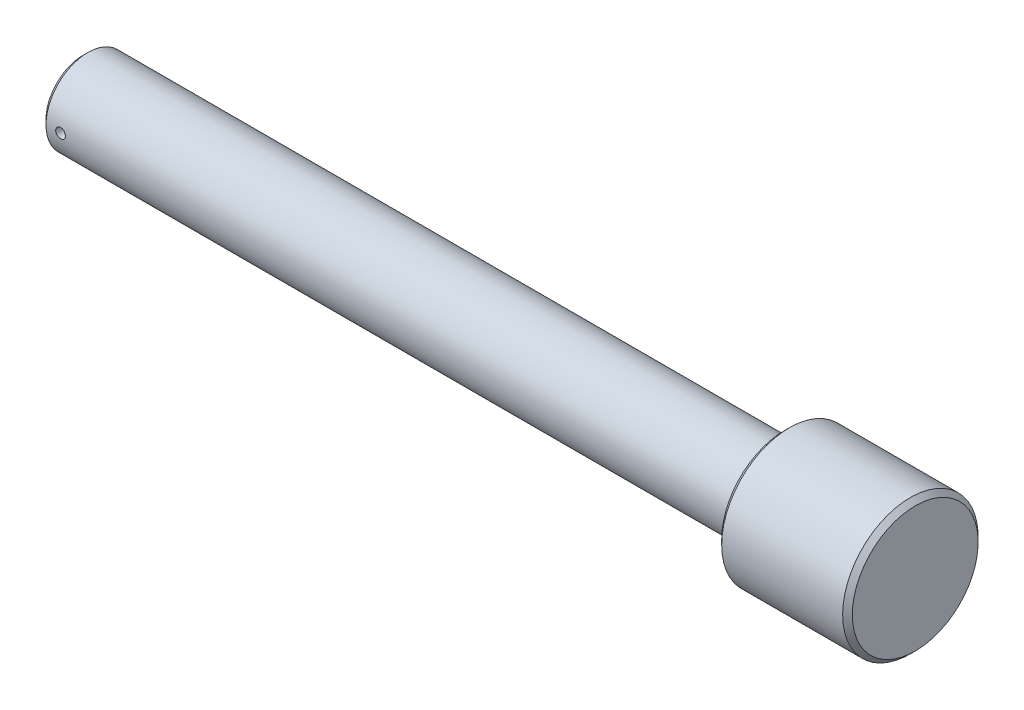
ISO-10303-21;
HEADER;
FILE_DESCRIPTION(('STEP AP214'),'2;1');
FILE_NAME('part.step','',(''),(''),'','','');
FILE_SCHEMA(('AUTOMOTIVE_DESIGN { 1 0 10303 214 1 1 1 1 }'));
ENDSEC;
DATA;
#1=APPLICATION_CONTEXT('core data for automotive mechanical design processes');
#2=APPLICATION_PROTOCOL_DEFINITION('international standard','automotive_design',2000,#1);
#3=PRODUCT_CONTEXT('',#1,'mechanical');
#4=PRODUCT('Part','Part','',(#3));
#5=PRODUCT_RELATED_PRODUCT_CATEGORY('part','',(#4));
#6=PRODUCT_DEFINITION_FORMATION('','',#4);
#7=PRODUCT_DEFINITION_CONTEXT('part definition',#1,'design');
#8=PRODUCT_DEFINITION('design','',#6,#7);
#9=PRODUCT_DEFINITION_SHAPE('','',#8);
#10=(LENGTH_UNIT() NAMED_UNIT(*) SI_UNIT(.MILLI.,.METRE.));
#11=(NAMED_UNIT(*) PLANE_ANGLE_UNIT() SI_UNIT($,.RADIAN.));
#12=(NAMED_UNIT(*) SI_UNIT($,.STERADIAN.) SOLID_ANGLE_UNIT());
#13=UNCERTAINTY_MEASURE_WITH_UNIT(LENGTH_MEASURE(1.E-05),#10,'distance_accuracy_value','');
#14=(GEOMETRIC_REPRESENTATION_CONTEXT(3) GLOBAL_UNCERTAINTY_ASSIGNED_CONTEXT((#13)) GLOBAL_UNIT_ASSIGNED_CONTEXT((#10,
#11,#12)) REPRESENTATION_CONTEXT('',''));
#15=CARTESIAN_POINT('',(0.,0.,0.));
#16=DIRECTION('',(0.,0.,1.));
#17=DIRECTION('',(1.,0.,0.));
#18=AXIS2_PLACEMENT_3D('',#15,#16,#17);
#19=CARTESIAN_POINT('',(0.,0.,0.));
#20=DIRECTION('',(1.,0.,0.));
#21=DIRECTION('',(0.,0.,-1.));
#22=AXIS2_PLACEMENT_3D('',#19,#20,#21);
#23=PLANE('',#22);
#24=CARTESIAN_POINT('',(0.,0.,0.));
#25=DIRECTION('',(-1.,0.,0.));
#26=DIRECTION('',(0.,0.,1.));
#27=AXIS2_PLACEMENT_3D('',#24,#25,#26);
#28=CIRCLE('',#27,7.65);
#29=CARTESIAN_POINT('',(0.,0.,7.65));
#30=VERTEX_POINT('',#29);
#31=EDGE_CURVE('E10',#30,#30,#28,.T.);
#32=ORIENTED_EDGE('',*,*,#31,.T.);
#33=EDGE_LOOP('',(#32));
#34=FACE_BOUND('',#33,.T.);
#35=ADVANCED_FACE('F33',(#34),#23,.F.);
#36=CARTESIAN_POINT('',(1.,0.,0.));
#37=DIRECTION('',(1.,0.,0.));
#38=DIRECTION('',(0.,0.,-1.));
#39=AXIS2_PLACEMENT_3D('',#36,#37,#38);
#40=CONICAL_SURFACE('',#39,8.65,0.785398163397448);
#41=ORIENTED_EDGE('',*,*,#31,.F.);
#42=EDGE_LOOP('',(#41));
#43=FACE_BOUND('',#42,.T.);
#44=CARTESIAN_POINT('',(1.,0.,0.));
#45=DIRECTION('',(-1.,0.,0.));
#46=DIRECTION('',(0.,0.,1.));
#47=AXIS2_PLACEMENT_3D('',#44,#45,#46);
#48=CIRCLE('',#47,8.65);
#49=CARTESIAN_POINT('',(1.,0.,8.65));
#50=VERTEX_POINT('',#49);
#51=EDGE_CURVE('E44',#50,#50,#48,.T.);
#52=ORIENTED_EDGE('',*,*,#51,.T.);
#53=EDGE_LOOP('',(#52));
#54=FACE_BOUND('',#53,.T.);
#55=ADVANCED_FACE('F86',(#43,#54),#40,.T.);
#56=CARTESIAN_POINT('',(0.,0.,0.));
#57=DIRECTION('',(-1.,0.,0.));
#58=DIRECTION('',(0.,0.,1.));
#59=AXIS2_PLACEMENT_3D('',#56,#57,#58);
#60=CYLINDRICAL_SURFACE('',#59,8.65);
#61=CARTESIAN_POINT('',(5.,0.,8.65));
#62=CARTESIAN_POINT('',(4.99999760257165,-0.0559701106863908,8.64999926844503));
#63=CARTESIAN_POINT('',(4.99528518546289,-0.111976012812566,8.64945101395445));
#64=CARTESIAN_POINT('',(4.97655951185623,-0.222431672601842,8.64731664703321));
#65=CARTESIAN_POINT('',(4.96253632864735,-0.276879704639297,8.64572942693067));
#66=CARTESIAN_POINT('',(4.92560581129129,-0.382604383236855,8.64169608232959));
#67=CARTESIAN_POINT('',(4.90270421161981,-0.433883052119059,8.63925051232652));
#68=CARTESIAN_POINT('',(4.84867895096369,-0.531858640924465,8.6337730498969));
#69=CARTESIAN_POINT('',(4.81755679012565,-0.578556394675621,8.63074126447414));
#70=CARTESIAN_POINT('',(4.74781587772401,-0.666276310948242,8.62441424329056));
#71=CARTESIAN_POINT('',(4.70916599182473,-0.707273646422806,8.6211179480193));
#72=CARTESIAN_POINT('',(4.62553347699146,-0.782215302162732,8.61464204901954));
#73=CARTESIAN_POINT('',(4.58055053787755,-0.816159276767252,8.61146245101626));
#74=CARTESIAN_POINT('',(4.4853696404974,-0.876121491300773,8.60556940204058));
#75=CARTESIAN_POINT('',(4.43515712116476,-0.902116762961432,8.60285731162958));
#76=CARTESIAN_POINT('',(4.33104285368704,-0.945296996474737,8.59822005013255));
#77=CARTESIAN_POINT('',(4.27714122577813,-0.962482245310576,8.59629485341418));
#78=CARTESIAN_POINT('',(4.16743494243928,-0.987479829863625,8.59345930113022));
#79=CARTESIAN_POINT('',(4.11163989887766,-0.995333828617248,8.59254443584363));
#80=CARTESIAN_POINT('',(3.99951670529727,-1.00157483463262,8.59181926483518));
#81=CARTESIAN_POINT('',(3.94318857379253,-0.999962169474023,8.59200892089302));
#82=CARTESIAN_POINT('',(3.83188723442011,-0.987349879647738,8.59346723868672));
#83=CARTESIAN_POINT('',(3.77690876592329,-0.97639598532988,8.59473064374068));
#84=CARTESIAN_POINT('',(3.66957571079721,-0.945483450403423,8.5981859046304));
#85=CARTESIAN_POINT('',(3.61722117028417,-0.925524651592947,8.60037777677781));
#86=CARTESIAN_POINT('',(3.51647909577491,-0.877119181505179,8.60544900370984));
#87=CARTESIAN_POINT('',(3.46810127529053,-0.84865247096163,8.60832997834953));
#88=CARTESIAN_POINT('',(3.37679228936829,-0.784053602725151,8.61445350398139));
#89=CARTESIAN_POINT('',(3.33386133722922,-0.747921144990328,8.61769606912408));
#90=CARTESIAN_POINT('',(3.25439918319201,-0.668762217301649,8.62420081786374));
#91=CARTESIAN_POINT('',(3.21790726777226,-0.625696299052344,8.62746300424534));
#92=CARTESIAN_POINT('',(3.15266439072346,-0.534029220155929,8.63362145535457));
#93=CARTESIAN_POINT('',(3.12391344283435,-0.485428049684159,8.6365177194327));
#94=CARTESIAN_POINT('',(3.07496925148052,-0.384041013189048,8.64161943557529));
#95=CARTESIAN_POINT('',(3.05477828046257,-0.331254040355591,8.64382470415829));
#96=CARTESIAN_POINT('',(3.0235574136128,-0.223007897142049,8.64729422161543));
#97=CARTESIAN_POINT('',(3.0125271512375,-0.16754883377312,8.64855850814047));
#98=CARTESIAN_POINT('',(2.99999129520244,-0.0558726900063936,8.64999874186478));
#99=CARTESIAN_POINT('',(2.99843154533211,0.000338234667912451,8.65018087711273));
#100=CARTESIAN_POINT('',(3.00473834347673,0.112220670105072,8.64945294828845));
#101=CARTESIAN_POINT('',(3.01260472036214,0.167892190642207,8.64854290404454));
#102=CARTESIAN_POINT('',(3.03749550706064,0.276957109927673,8.64573676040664));
#103=CARTESIAN_POINT('',(3.05449428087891,0.330356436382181,8.6438434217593));
#104=CARTESIAN_POINT('',(3.09714079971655,0.433546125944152,8.6392828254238));
#105=CARTESIAN_POINT('',(3.12278879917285,0.483336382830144,8.63661554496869));
#106=CARTESIAN_POINT('',(3.18213805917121,0.578137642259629,8.63078938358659));
#107=CARTESIAN_POINT('',(3.2158745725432,0.623126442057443,8.62762837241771));
#108=CARTESIAN_POINT('',(3.29039306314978,0.706822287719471,8.62117553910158));
#109=CARTESIAN_POINT('',(3.33117527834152,0.745529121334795,8.61788371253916));
#110=CARTESIAN_POINT('',(3.41886518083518,0.815752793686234,8.61152135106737));
#111=CARTESIAN_POINT('',(3.46580159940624,0.847233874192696,8.60845196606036));
#112=CARTESIAN_POINT('',(3.56432722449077,0.901865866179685,8.60290039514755));
#113=CARTESIAN_POINT('',(3.61591634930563,0.925016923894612,8.60041819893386));
#114=CARTESIAN_POINT('',(3.72216467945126,0.962273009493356,8.59632965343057));
#115=CARTESIAN_POINT('',(3.77681657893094,0.976398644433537,8.59472131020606));
#116=CARTESIAN_POINT('',(3.88773626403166,0.995269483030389,8.59255668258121));
#117=CARTESIAN_POINT('',(3.94400398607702,1.00001505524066,8.59200035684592));
#118=CARTESIAN_POINT('',(4.05620249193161,0.999984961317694,8.59200383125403));
#119=CARTESIAN_POINT('',(4.11213329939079,0.995265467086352,8.59255704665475));
#120=CARTESIAN_POINT('',(4.22240136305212,0.976557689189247,8.59470316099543));
#121=CARTESIAN_POINT('',(4.27673861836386,0.962569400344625,8.5962960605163));
#122=CARTESIAN_POINT('',(4.38227250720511,0.92573786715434,8.60034011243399));
#123=CARTESIAN_POINT('',(4.43346994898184,0.902896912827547,8.60279104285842));
#124=CARTESIAN_POINT('',(4.53131403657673,0.849014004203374,8.60827540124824));
#125=CARTESIAN_POINT('',(4.57796065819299,0.817972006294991,8.6113088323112));
#126=CARTESIAN_POINT('',(4.66566652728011,0.748358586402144,8.6176379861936));
#127=CARTESIAN_POINT('',(4.70669242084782,0.709745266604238,8.62093510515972));
#128=CARTESIAN_POINT('',(4.78170484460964,0.626171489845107,8.62740760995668));
#129=CARTESIAN_POINT('',(4.8156897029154,0.581209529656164,8.63058296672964));
#130=CARTESIAN_POINT('',(4.87574774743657,0.486048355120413,8.63646543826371));
#131=CARTESIAN_POINT('',(4.90179465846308,0.435832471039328,8.63917098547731));
#132=CARTESIAN_POINT('',(4.94505013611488,0.331737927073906,8.64379275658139));
#133=CARTESIAN_POINT('',(4.96226845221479,0.277863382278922,8.64570985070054));
#134=CARTESIAN_POINT('',(4.98318702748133,0.186416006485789,8.64806867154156));
#135=CARTESIAN_POINT('',(4.98948301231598,0.149423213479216,8.64878945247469));
#136=CARTESIAN_POINT('',(4.99789028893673,0.0749589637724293,8.6497553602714));
#137=CARTESIAN_POINT('',(5.0000016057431,0.0374875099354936,8.65000048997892));
#138=CARTESIAN_POINT('',(5.,0.,8.65));
#139=B_SPLINE_CURVE_WITH_KNOTS('',3,(#61,#62,#63,#64,#65,#66,#67,#68,#69,#70,#71,#72,#73,#74,
#75,#76,#77,#78,#79,#80,#81,#82,#83,#84,#85,#86,#87,#88,#89,#90,#91,#92,#93,#94,#95,#96,#97,#98,
#99,#100,#101,#102,#103,#104,#105,#106,#107,#108,#109,#110,#111,#112,#113,#114,#115,#116,#117,
#118,#119,#120,#121,#122,#123,#124,#125,#126,#127,#128,#129,#130,#131,#132,#133,#134,#135,#136,
#137,#138),.UNSPECIFIED.,.T.,.F.,(4,2,2,2,2,2,2,2,2,2,2,2,2,2,2,2,2,2,2,2,2,2,2,2,2,2,2,2,2,2,2,
2,2,2,2,2,2,2,4),(0.,0.167773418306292,0.335725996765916,0.503570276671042,0.671383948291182,
0.839907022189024,1.00843835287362,1.17745216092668,1.34646046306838,1.51471129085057,
1.68295629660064,1.85038234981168,2.01781134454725,2.18563784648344,2.35347091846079,
2.52229502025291,2.69111942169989,2.85998861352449,3.02885104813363,3.19674694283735,
3.36463978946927,3.53206377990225,3.69949269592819,3.86766503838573,4.03584306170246,
4.20483622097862,4.37382641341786,4.54242937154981,4.71102570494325,4.87862443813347,
5.0462232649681,5.21377876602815,5.38133515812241,5.54984635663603,5.71839752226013,
5.88750069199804,6.05641671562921,6.16878821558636,6.28115904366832),.UNSPECIFIED.);
#140=CARTESIAN_POINT('',(5.,0.,8.65));
#141=VERTEX_POINT('',#140);
#142=EDGE_CURVE('E36',#141,#141,#139,.T.);
#143=ORIENTED_EDGE('',*,*,#142,.T.);
#144=EDGE_LOOP('',(#143));
#145=FACE_BOUND('',#144,.T.);
#146=CARTESIAN_POINT('',(5.,0.,-8.65));
#147=CARTESIAN_POINT('',(4.99999760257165,0.0559701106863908,-8.64999926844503));
#148=CARTESIAN_POINT('',(4.99528518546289,0.111976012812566,-8.64945101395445));
#149=CARTESIAN_POINT('',(4.97655951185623,0.222431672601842,-8.64731664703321));
#150=CARTESIAN_POINT('',(4.96253632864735,0.276879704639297,-8.64572942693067));
#151=CARTESIAN_POINT('',(4.92560581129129,0.382604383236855,-8.64169608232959));
#152=CARTESIAN_POINT('',(4.90270421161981,0.433883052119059,-8.63925051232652));
#153=CARTESIAN_POINT('',(4.84867895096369,0.531858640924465,-8.6337730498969));
#154=CARTESIAN_POINT('',(4.81755679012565,0.578556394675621,-8.63074126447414));
#155=CARTESIAN_POINT('',(4.74781587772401,0.666276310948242,-8.62441424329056));
#156=CARTESIAN_POINT('',(4.70916599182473,0.707273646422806,-8.6211179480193));
#157=CARTESIAN_POINT('',(4.62553347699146,0.782215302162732,-8.61464204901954));
#158=CARTESIAN_POINT('',(4.58055053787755,0.816159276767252,-8.61146245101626));
#159=CARTESIAN_POINT('',(4.4853696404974,0.876121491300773,-8.60556940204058));
#160=CARTESIAN_POINT('',(4.43515712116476,0.902116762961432,-8.60285731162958));
#161=CARTESIAN_POINT('',(4.33104285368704,0.945296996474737,-8.59822005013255));
#162=CARTESIAN_POINT('',(4.27714122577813,0.962482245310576,-8.59629485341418));
#163=CARTESIAN_POINT('',(4.16743494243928,0.987479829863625,-8.59345930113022));
#164=CARTESIAN_POINT('',(4.11163989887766,0.995333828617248,-8.59254443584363));
#165=CARTESIAN_POINT('',(3.99951670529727,1.00157483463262,-8.59181926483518));
#166=CARTESIAN_POINT('',(3.94318857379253,0.999962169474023,-8.59200892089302));
#167=CARTESIAN_POINT('',(3.83188723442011,0.987349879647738,-8.59346723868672));
#168=CARTESIAN_POINT('',(3.77690876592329,0.97639598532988,-8.59473064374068));
#169=CARTESIAN_POINT('',(3.66957571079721,0.945483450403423,-8.5981859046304));
#170=CARTESIAN_POINT('',(3.61722117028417,0.925524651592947,-8.60037777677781));
#171=CARTESIAN_POINT('',(3.51647909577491,0.877119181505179,-8.60544900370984));
#172=CARTESIAN_POINT('',(3.46810127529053,0.84865247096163,-8.60832997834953));
#173=CARTESIAN_POINT('',(3.37679228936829,0.784053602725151,-8.61445350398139));
#174=CARTESIAN_POINT('',(3.33386133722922,0.747921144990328,-8.61769606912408));
#175=CARTESIAN_POINT('',(3.25439918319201,0.668762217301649,-8.62420081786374));
#176=CARTESIAN_POINT('',(3.21790726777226,0.625696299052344,-8.62746300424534));
#177=CARTESIAN_POINT('',(3.15266439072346,0.534029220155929,-8.63362145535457));
#178=CARTESIAN_POINT('',(3.12391344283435,0.485428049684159,-8.6365177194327));
#179=CARTESIAN_POINT('',(3.07496925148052,0.384041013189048,-8.64161943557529));
#180=CARTESIAN_POINT('',(3.05477828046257,0.331254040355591,-8.64382470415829));
#181=CARTESIAN_POINT('',(3.0235574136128,0.223007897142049,-8.64729422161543));
#182=CARTESIAN_POINT('',(3.0125271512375,0.16754883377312,-8.64855850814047));
#183=CARTESIAN_POINT('',(2.99999129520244,0.0558726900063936,-8.64999874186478));
#184=CARTESIAN_POINT('',(2.99843154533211,-0.000338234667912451,-8.65018087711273));
#185=CARTESIAN_POINT('',(3.00473834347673,-0.112220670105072,-8.64945294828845));
#186=CARTESIAN_POINT('',(3.01260472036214,-0.167892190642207,-8.64854290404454));
#187=CARTESIAN_POINT('',(3.03749550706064,-0.276957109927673,-8.64573676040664));
#188=CARTESIAN_POINT('',(3.05449428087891,-0.330356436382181,-8.6438434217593));
#189=CARTESIAN_POINT('',(3.09714079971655,-0.433546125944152,-8.6392828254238));
#190=CARTESIAN_POINT('',(3.12278879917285,-0.483336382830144,-8.63661554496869));
#191=CARTESIAN_POINT('',(3.18213805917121,-0.578137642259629,-8.63078938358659));
#192=CARTESIAN_POINT('',(3.2158745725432,-0.623126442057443,-8.62762837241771));
#193=CARTESIAN_POINT('',(3.29039306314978,-0.706822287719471,-8.62117553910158));
#194=CARTESIAN_POINT('',(3.33117527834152,-0.745529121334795,-8.61788371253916));
#195=CARTESIAN_POINT('',(3.41886518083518,-0.815752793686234,-8.61152135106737));
#196=CARTESIAN_POINT('',(3.46580159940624,-0.847233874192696,-8.60845196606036));
#197=CARTESIAN_POINT('',(3.56432722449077,-0.901865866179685,-8.60290039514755));
#198=CARTESIAN_POINT('',(3.61591634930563,-0.925016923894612,-8.60041819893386));
#199=CARTESIAN_POINT('',(3.72216467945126,-0.962273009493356,-8.59632965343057));
#200=CARTESIAN_POINT('',(3.77681657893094,-0.976398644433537,-8.59472131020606));
#201=CARTESIAN_POINT('',(3.88773626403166,-0.995269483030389,-8.59255668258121));
#202=CARTESIAN_POINT('',(3.94400398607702,-1.00001505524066,-8.59200035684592));
#203=CARTESIAN_POINT('',(4.05620249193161,-0.999984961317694,-8.59200383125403));
#204=CARTESIAN_POINT('',(4.11213329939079,-0.995265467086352,-8.59255704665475));
#205=CARTESIAN_POINT('',(4.22240136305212,-0.976557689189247,-8.59470316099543));
#206=CARTESIAN_POINT('',(4.27673861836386,-0.962569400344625,-8.5962960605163));
#207=CARTESIAN_POINT('',(4.38227250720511,-0.92573786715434,-8.60034011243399));
#208=CARTESIAN_POINT('',(4.43346994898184,-0.902896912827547,-8.60279104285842));
#209=CARTESIAN_POINT('',(4.53131403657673,-0.849014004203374,-8.60827540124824));
#210=CARTESIAN_POINT('',(4.57796065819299,-0.817972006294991,-8.6113088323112));
#211=CARTESIAN_POINT('',(4.66566652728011,-0.748358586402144,-8.6176379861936));
#212=CARTESIAN_POINT('',(4.70669242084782,-0.709745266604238,-8.62093510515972));
#213=CARTESIAN_POINT('',(4.78170484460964,-0.626171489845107,-8.62740760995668));
#214=CARTESIAN_POINT('',(4.8156897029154,-0.581209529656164,-8.63058296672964));
#215=CARTESIAN_POINT('',(4.87574774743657,-0.486048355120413,-8.63646543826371));
#216=CARTESIAN_POINT('',(4.90179465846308,-0.435832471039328,-8.63917098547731));
#217=CARTESIAN_POINT('',(4.94505013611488,-0.331737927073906,-8.64379275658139));
#218=CARTESIAN_POINT('',(4.96226845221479,-0.277863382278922,-8.64570985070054));
#219=CARTESIAN_POINT('',(4.98318702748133,-0.186416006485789,-8.64806867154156));
#220=CARTESIAN_POINT('',(4.98948301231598,-0.149423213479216,-8.64878945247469));
#221=CARTESIAN_POINT('',(4.99789028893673,-0.0749589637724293,-8.6497553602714));
#222=CARTESIAN_POINT('',(5.0000016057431,-0.0374875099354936,-8.65000048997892));
#223=CARTESIAN_POINT('',(5.,0.,-8.65));
#224=B_SPLINE_CURVE_WITH_KNOTS('',3,(#146,#147,#148,#149,#150,#151,#152,#153,#154,#155,#156,
#157,#158,#159,#160,#161,#162,#163,#164,#165,#166,#167,#168,#169,#170,#171,#172,#173,#174,#175,
#176,#177,#178,#179,#180,#181,#182,#183,#184,#185,#186,#187,#188,#189,#190,#191,#192,#193,#194,
#195,#196,#197,#198,#199,#200,#201,#202,#203,#204,#205,#206,#207,#208,#209,#210,#211,#212,#213,
#214,#215,#216,#217,#218,#219,#220,#221,#222,#223),.UNSPECIFIED.,.T.,.F.,(4,2,2,2,2,2,2,2,2,2,2,
2,2,2,2,2,2,2,2,2,2,2,2,2,2,2,2,2,2,2,2,2,2,2,2,2,2,2,4),(0.,0.167773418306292,
0.335725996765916,0.503570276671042,0.671383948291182,0.839907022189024,1.00843835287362,
1.17745216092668,1.34646046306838,1.51471129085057,1.68295629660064,1.85038234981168,
2.01781134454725,2.18563784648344,2.35347091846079,2.52229502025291,2.69111942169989,
2.85998861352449,3.02885104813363,3.19674694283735,3.36463978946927,3.53206377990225,
3.69949269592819,3.86766503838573,4.03584306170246,4.20483622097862,4.37382641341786,
4.54242937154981,4.71102570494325,4.87862443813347,5.0462232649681,5.21377876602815,
5.38133515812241,5.54984635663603,5.71839752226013,5.88750069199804,6.05641671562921,
6.16878821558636,6.28115904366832),.UNSPECIFIED.);
#225=CARTESIAN_POINT('',(5.,0.,-8.65));
#226=VERTEX_POINT('',#225);
#227=EDGE_CURVE('E52',#226,#226,#224,.T.);
#228=ORIENTED_EDGE('',*,*,#227,.T.);
#229=EDGE_LOOP('',(#228));
#230=FACE_BOUND('',#229,.T.);
#231=ORIENTED_EDGE('',*,*,#51,.F.);
#232=EDGE_LOOP('',(#231));
#233=FACE_BOUND('',#232,.T.);
#234=CARTESIAN_POINT('',(145.,0.,0.));
#235=DIRECTION('',(-1.,0.,0.));
#236=DIRECTION('',(0.,0.,1.));
#237=AXIS2_PLACEMENT_3D('',#234,#235,#236);
#238=CIRCLE('',#237,8.65);
#239=CARTESIAN_POINT('',(145.,0.,8.65));
#240=VERTEX_POINT('',#239);
#241=EDGE_CURVE('E49',#240,#240,#238,.T.);
#242=ORIENTED_EDGE('',*,*,#241,.T.);
#243=EDGE_LOOP('',(#242));
#244=FACE_BOUND('',#243,.T.);
#245=ADVANCED_FACE('F56',(#145,#230,#233,#244),#60,.T.);
#246=CARTESIAN_POINT('',(145.,8.65,0.));
#247=DIRECTION('',(1.,0.,0.));
#248=DIRECTION('',(0.,0.,-1.));
#249=AXIS2_PLACEMENT_3D('',#246,#247,#248);
#250=PLANE('',#249);
#251=ORIENTED_EDGE('',*,*,#241,.F.);
#252=EDGE_LOOP('',(#251));
#253=FACE_BOUND('',#252,.T.);
#254=CARTESIAN_POINT('',(145.,0.,0.));
#255=DIRECTION('',(-1.,0.,0.));
#256=DIRECTION('',(0.,0.,1.));
#257=AXIS2_PLACEMENT_3D('',#254,#255,#256);
#258=CIRCLE('',#257,13.);
#259=CARTESIAN_POINT('',(145.,0.,13.));
#260=VERTEX_POINT('',#259);
#261=EDGE_CURVE('E102',#260,#260,#258,.T.);
#262=ORIENTED_EDGE('',*,*,#261,.T.);
#263=EDGE_LOOP('',(#262));
#264=FACE_BOUND('',#263,.T.);
#265=ADVANCED_FACE('F79',(#253,#264),#250,.F.);
#266=CARTESIAN_POINT('',(146.,0.,0.));
#267=DIRECTION('',(1.,0.,0.));
#268=DIRECTION('',(0.,0.,-1.));
#269=AXIS2_PLACEMENT_3D('',#266,#267,#268);
#270=CONICAL_SURFACE('',#269,14.,0.785398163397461);
#271=ORIENTED_EDGE('',*,*,#261,.F.);
#272=EDGE_LOOP('',(#271));
#273=FACE_BOUND('',#272,.T.);
#274=CARTESIAN_POINT('',(146.,0.,0.));
#275=DIRECTION('',(-1.,0.,0.));
#276=DIRECTION('',(0.,0.,1.));
#277=AXIS2_PLACEMENT_3D('',#274,#275,#276);
#278=CIRCLE('',#277,14.);
#279=CARTESIAN_POINT('',(146.,0.,14.));
#280=VERTEX_POINT('',#279);
#281=EDGE_CURVE('E104',#280,#280,#278,.T.);
#282=ORIENTED_EDGE('',*,*,#281,.T.);
#283=EDGE_LOOP('',(#282));
#284=FACE_BOUND('',#283,.T.);
#285=ADVANCED_FACE('F76',(#273,#284),#270,.T.);
#286=CARTESIAN_POINT('',(0.,0.,0.));
#287=DIRECTION('',(-1.,0.,0.));
#288=DIRECTION('',(0.,0.,1.));
#289=AXIS2_PLACEMENT_3D('',#286,#287,#288);
#290=CYLINDRICAL_SURFACE('',#289,14.);
#291=ORIENTED_EDGE('',*,*,#281,.F.);
#292=EDGE_LOOP('',(#291));
#293=FACE_BOUND('',#292,.T.);
#294=CARTESIAN_POINT('',(171.,0.,0.));
#295=DIRECTION('',(-1.,0.,0.));
#296=DIRECTION('',(0.,0.,1.));
#297=AXIS2_PLACEMENT_3D('',#294,#295,#296);
#298=CIRCLE('',#297,14.);
#299=CARTESIAN_POINT('',(171.,0.,14.));
#300=VERTEX_POINT('',#299);
#301=EDGE_CURVE('E109',#300,#300,#298,.T.);
#302=ORIENTED_EDGE('',*,*,#301,.T.);
#303=EDGE_LOOP('',(#302));
#304=FACE_BOUND('',#303,.T.);
#305=ADVANCED_FACE('F72',(#293,#304),#290,.T.);
#306=CARTESIAN_POINT('',(172.,0.,0.));
#307=DIRECTION('',(-1.,0.,0.));
#308=DIRECTION('',(0.,0.,1.));
#309=AXIS2_PLACEMENT_3D('',#306,#307,#308);
#310=CONICAL_SURFACE('',#309,13.,0.785398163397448);
#311=ORIENTED_EDGE('',*,*,#301,.F.);
#312=EDGE_LOOP('',(#311));
#313=FACE_BOUND('',#312,.T.);
#314=CARTESIAN_POINT('',(172.,0.,0.));
#315=DIRECTION('',(-1.,0.,0.));
#316=DIRECTION('',(0.,0.,1.));
#317=AXIS2_PLACEMENT_3D('',#314,#315,#316);
#318=CIRCLE('',#317,13.);
#319=CARTESIAN_POINT('',(172.,0.,13.));
#320=VERTEX_POINT('',#319);
#321=EDGE_CURVE('E112',#320,#320,#318,.T.);
#322=ORIENTED_EDGE('',*,*,#321,.T.);
#323=EDGE_LOOP('',(#322));
#324=FACE_BOUND('',#323,.T.);
#325=ADVANCED_FACE('F68',(#313,#324),#310,.T.);
#326=CARTESIAN_POINT('',(172.,13.,0.));
#327=DIRECTION('',(-1.,0.,0.));
#328=DIRECTION('',(0.,0.,1.));
#329=AXIS2_PLACEMENT_3D('',#326,#327,#328);
#330=PLANE('',#329);
#331=ORIENTED_EDGE('',*,*,#321,.F.);
#332=EDGE_LOOP('',(#331));
#333=FACE_BOUND('',#332,.T.);
#334=ADVANCED_FACE('F63',(#333),#330,.F.);
#335=CARTESIAN_POINT('',(4.,0.,-14.));
#336=DIRECTION('',(0.,0.,1.));
#337=DIRECTION('',(1.,0.,0.));
#338=AXIS2_PLACEMENT_3D('',#335,#336,#337);
#339=CYLINDRICAL_SURFACE('',#338,1.);
#340=ORIENTED_EDGE('',*,*,#227,.F.);
#341=EDGE_LOOP('',(#340));
#342=FACE_BOUND('',#341,.T.);
#343=ORIENTED_EDGE('',*,*,#142,.F.);
#344=EDGE_LOOP('',(#343));
#345=FACE_BOUND('',#344,.T.);
#346=ADVANCED_FACE('F59',(#342,#345),#339,.F.);
#347=CLOSED_SHELL('',(#35,#55,#245,#265,#285,#305,#325,#334,#346));
#348=MANIFOLD_SOLID_BREP('B2',#347);
#349=ADVANCED_BREP_SHAPE_REPRESENTATION('',(#18,#348),#14);
#350=SHAPE_DEFINITION_REPRESENTATION(#9,#349);
ENDSEC;
END-ISO-10303-21;
